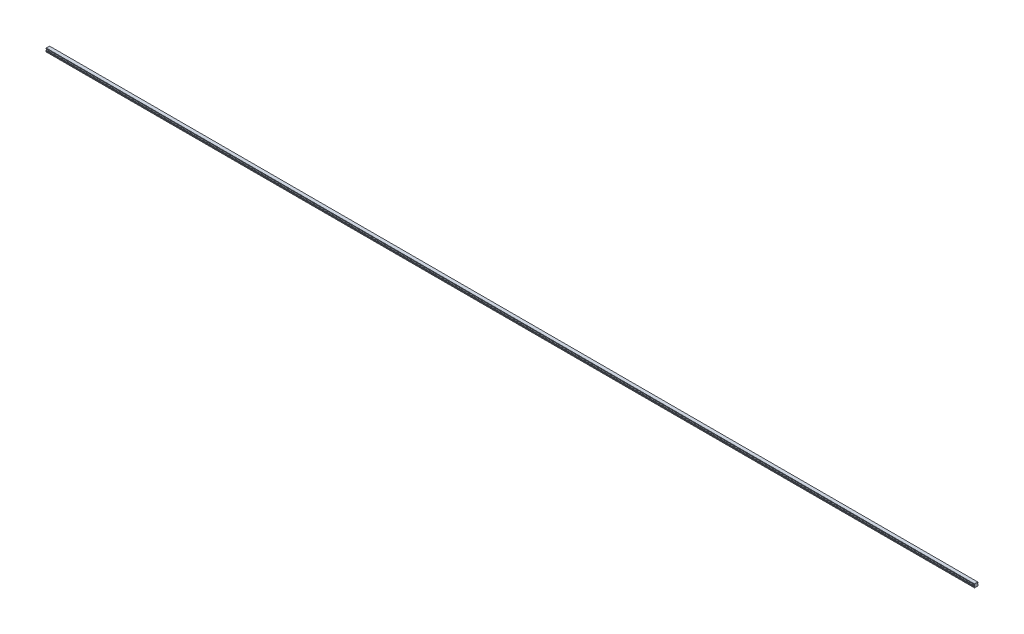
from build123d import *

# Parameters (mm, degrees)
BOSS_EXTRUDE1_DEPTH        = 3660
SKETCH3_R                  = 2.5
SKETCH3_R_2                = 2.1
CUT_EXTRUDE3_DEPTH         = 7
SKETCH3_2_R                = 2.1
CUT_EXTRUDE4_DEPTH         = 9.5
CHAMFER1_SIZE              = 0.4
LPATTERN2_COUNT            = 61
LPATTERN2_PITCH            = 60
CHAMFER1_OF_LPATTERN2_SIZE = 0.4


with BuildPart() as part:
    # Sketch1 → Boss-Extrude1 (new body)
    with BuildSketch(Plane(origin=(0, 0, 0), x_dir=(0, 0, -1), z_dir=(1, 0, 0))):
        with BuildLine():
            Line((6.59, 14), (-6.59, 14))
            Line((-6.59, 14), (-6.59, 13.15))
            Line((-6.59, 13.15), (-6.96, 12.356532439))
            Line((-6.96, 12.356532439), (-6.96, 11.435174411))
            ThreePointArc((-6.96, 11.435174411), (-5.25, 9.5), (-6.96, 7.564825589))
            Line((-6.96, 7.564825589), (-6.96, 6.643467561))
            Line((-6.96, 6.643467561), (-6.59, 5.85))
            Line((-6.59, 5.85), (-7.032116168, 4.2))
            Line((-7.032116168, 4.2), (-7.5, 3.929867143))
            Line((-7.5, 3.929867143), (-7.5, 1.4))
            Line((-7.5, 1.4), (-6.1, 0))
            Line((-6.1, 0), (-3.65, 0))
            Line((-3.65, 0), (-3.25, 0.4))
            Line((-3.25, 0.4), (3.25, 0.4))
            Line((3.25, 0.4), (3.65, 0))
            Line((3.65, 0), (6.1, 0))
            Line((6.1, 0), (7.5, 1.4))
            Line((7.5, 1.4), (7.5, 3.929867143))
            Line((7.5, 3.929867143), (7.032116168, 4.2))
            Line((7.032116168, 4.2), (6.59, 5.85))
            Line((6.59, 5.85), (6.96, 6.643467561))
            Line((6.96, 6.643467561), (6.96, 7.564825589))
            ThreePointArc((6.96, 7.564825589), (5.25, 9.5), (6.96, 11.435174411))
            Line((6.96, 11.435174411), (6.96, 12.356532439))
            Line((6.96, 12.356532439), (6.59, 13.15))
            Line((6.59, 13.15), (6.59, 14))
        make_face()
    extrude(amount=BOSS_EXTRUDE1_DEPTH)

    # Sketch3 → Cut-Extrude3 (cut)
    with BuildSketch(Plane.XZ):
        with Locations(Location((30, 0, 0), (0, 0, 270))):
            Circle(SKETCH3_R)
        with Locations(Location((30, 0, 0), (0, 0, 270))):
            Circle(SKETCH3_R_2, mode=Mode.SUBTRACT)
    cut_extrude3 = extrude(amount=-CUT_EXTRUDE3_DEPTH, mode=Mode.SUBTRACT)

    # Sketch3_2 → Cut-Extrude4 (cut)
    with BuildSketch(Plane.XZ):
        with Locations(Location((30, 0, 0), (0, 0, 270))):
            Circle(SKETCH3_2_R)
    cut_extrude4 = extrude(amount=-CUT_EXTRUDE4_DEPTH, mode=Mode.SUBTRACT)

    # Cut-Extrude5 cone 1 section (on through the dimple's axis) → Cut-Extrude5 (revolve, cut)
    with BuildSketch(Plane(origin=(30, 9.5, 0), x_dir=(0, 0, -1), z_dir=(1, 0, 0))):
        Polygon((0, 0), (2.1, 0), (0, 1.212435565), align=None)
    revolve(axis=Axis((30, 9.5, 0), (0, 1, 0)), mode=Mode.SUBTRACT)

    # Chamfer1
    chamfer1_edges = [part.edges().sort_by_distance(p)[0] for p in [
        (30, 0.4, 2.5),
    ]]
    chamfer(chamfer1_edges, length=CHAMFER1_SIZE)

    # LPattern2: Cut-Extrude3, Cut-Extrude4 ×61
    with Locations(*[(i * LPATTERN2_PITCH, 0, 0) for i in range(1, LPATTERN2_COUNT)]):
        add(cut_extrude3, mode=Mode.SUBTRACT)
        add(cut_extrude4, mode=Mode.SUBTRACT)

    # Chamfer1 of LPattern2
    chamfer1_of_lpattern2_edges = [part.edges().sort_by_distance(p)[0] for p in [
        (90, 0.4, 2.5),
        (150, 0.4, 2.5),
        (210, 0.4, 2.5),
        (270, 0.4, 2.5),
        (330, 0.4, 2.5),
        (390, 0.4, 2.5),
        (450, 0.4, 2.5),
        (510, 0.4, 2.5),
        (570, 0.4, 2.5),
        (630, 0.4, 2.5),
        (690, 0.4, 2.5),
        (750, 0.4, 2.5),
        (810, 0.4, 2.5),
        (870, 0.4, 2.5),
        (930, 0.4, 2.5),
        (990, 0.4, 2.5),
        (1050, 0.4, 2.5),
        (1110, 0.4, 2.5),
        (1170, 0.4, 2.5),
        (1230, 0.4, 2.5),
        (1290, 0.4, 2.5),
        (1350, 0.4, 2.5),
        (1410, 0.4, 2.5),
        (1470, 0.4, 2.5),
        (1530, 0.4, 2.5),
        (1590, 0.4, 2.5),
        (1650, 0.4, 2.5),
        (1710, 0.4, 2.5),
        (1770, 0.4, 2.5),
        (1830, 0.4, 2.5),
        (1890, 0.4, 2.5),
        (1950, 0.4, 2.5),
        (2010, 0.4, 2.5),
        (2070, 0.4, 2.5),
        (2130, 0.4, 2.5),
        (2190, 0.4, 2.5),
        (2250, 0.4, 2.5),
        (2310, 0.4, 2.5),
        (2370, 0.4, 2.5),
        (2430, 0.4, 2.5),
        (2490, 0.4, 2.5),
        (2550, 0.4, 2.5),
        (2610, 0.4, 2.5),
        (2670, 0.4, 2.5),
        (2730, 0.4, 2.5),
        (2790, 0.4, 2.5),
        (2850, 0.4, 2.5),
        (2910, 0.4, 2.5),
        (2970, 0.4, 2.5),
        (3030, 0.4, 2.5),
        (3090, 0.4, 2.5),
        (3150, 0.4, 2.5),
        (3210, 0.4, 2.5),
        (3270, 0.4, 2.5),
        (3330, 0.4, 2.5),
        (3390, 0.4, 2.5),
        (3450, 0.4, 2.5),
        (3510, 0.4, 2.5),
        (3570, 0.4, 2.5),
        (3630, 0.4, 2.5),
    ]]
    chamfer(chamfer1_of_lpattern2_edges, length=CHAMFER1_OF_LPATTERN2_SIZE)


solid = part.part
